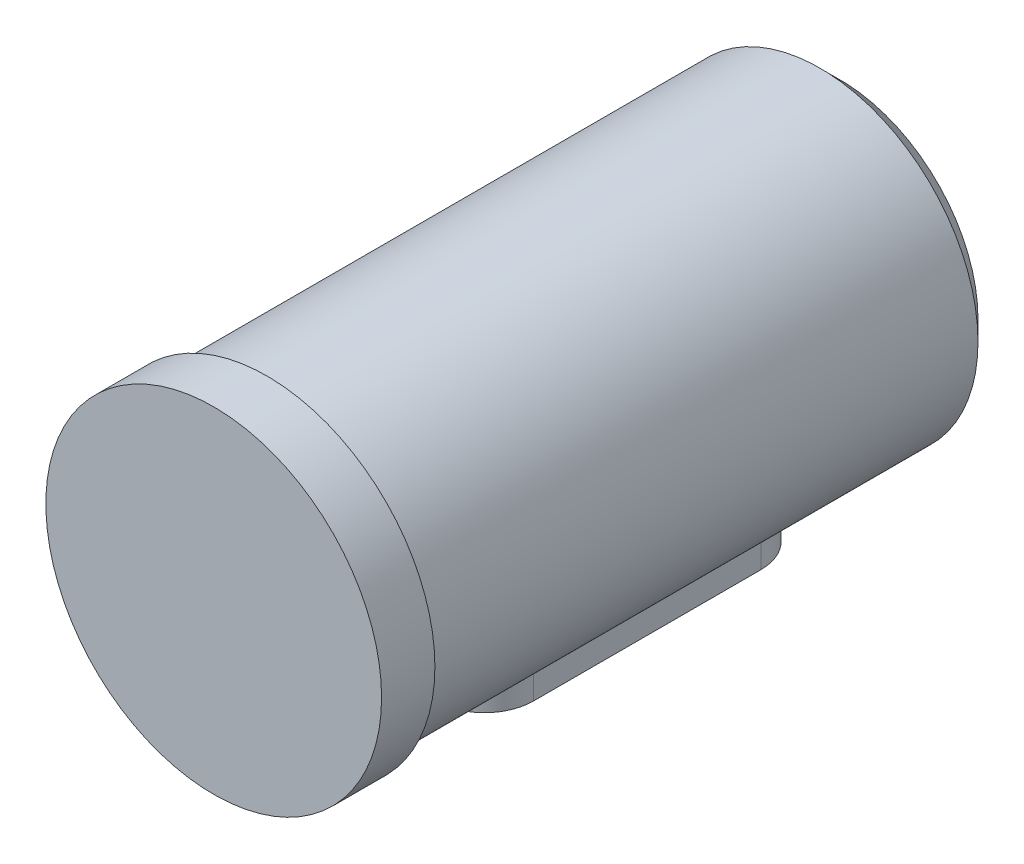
ISO-10303-21;
HEADER;
FILE_DESCRIPTION(('STEP AP214'),'2;1');
FILE_NAME('part.step','',(''),(''),'','','');
FILE_SCHEMA(('AUTOMOTIVE_DESIGN { 1 0 10303 214 1 1 1 1 }'));
ENDSEC;
DATA;
#1=APPLICATION_CONTEXT('core data for automotive mechanical design processes');
#2=APPLICATION_PROTOCOL_DEFINITION('international standard','automotive_design',2000,#1);
#3=PRODUCT_CONTEXT('',#1,'mechanical');
#4=PRODUCT('Part','Part','',(#3));
#5=PRODUCT_RELATED_PRODUCT_CATEGORY('part','',(#4));
#6=PRODUCT_DEFINITION_FORMATION('','',#4);
#7=PRODUCT_DEFINITION_CONTEXT('part definition',#1,'design');
#8=PRODUCT_DEFINITION('design','',#6,#7);
#9=PRODUCT_DEFINITION_SHAPE('','',#8);
#10=(LENGTH_UNIT() NAMED_UNIT(*) SI_UNIT(.MILLI.,.METRE.));
#11=(NAMED_UNIT(*) PLANE_ANGLE_UNIT() SI_UNIT($,.RADIAN.));
#12=(NAMED_UNIT(*) SI_UNIT($,.STERADIAN.) SOLID_ANGLE_UNIT());
#13=UNCERTAINTY_MEASURE_WITH_UNIT(LENGTH_MEASURE(1.E-05),#10,'distance_accuracy_value','');
#14=(GEOMETRIC_REPRESENTATION_CONTEXT(3) GLOBAL_UNCERTAINTY_ASSIGNED_CONTEXT((#13)) GLOBAL_UNIT_ASSIGNED_CONTEXT((#10,
#11,#12)) REPRESENTATION_CONTEXT('',''));
#15=CARTESIAN_POINT('',(0.,0.,0.));
#16=DIRECTION('',(0.,0.,1.));
#17=DIRECTION('',(1.,0.,0.));
#18=AXIS2_PLACEMENT_3D('',#15,#16,#17);
#19=CARTESIAN_POINT('',(0.,0.,0.));
#20=DIRECTION('',(0.,0.,1.));
#21=DIRECTION('',(1.,0.,0.));
#22=AXIS2_PLACEMENT_3D('',#19,#20,#21);
#23=CYLINDRICAL_SURFACE('',#22,8.);
#24=CARTESIAN_POINT('',(0.,0.,-7.7));
#25=DIRECTION('',(0.,0.,1.));
#26=DIRECTION('',(1.,0.,0.));
#27=AXIS2_PLACEMENT_3D('',#24,#25,#26);
#28=CIRCLE('',#27,8.);
#29=CARTESIAN_POINT('',(8.,0.,-7.7));
#30=VERTEX_POINT('',#29);
#31=EDGE_CURVE('E163',#30,#30,#28,.T.);
#32=ORIENTED_EDGE('',*,*,#31,.F.);
#33=EDGE_LOOP('',(#32));
#34=FACE_BOUND('',#33,.T.);
#35=CARTESIAN_POINT('',(0.,0.,-35.7));
#36=DIRECTION('',(0.,0.,1.));
#37=DIRECTION('',(1.,0.,0.));
#38=AXIS2_PLACEMENT_3D('',#35,#36,#37);
#39=CIRCLE('',#38,8.);
#40=CARTESIAN_POINT('',(8.,0.,-35.7));
#41=VERTEX_POINT('',#40);
#42=EDGE_CURVE('E40',#41,#41,#39,.T.);
#43=ORIENTED_EDGE('',*,*,#42,.T.);
#44=EDGE_LOOP('',(#43));
#45=FACE_BOUND('',#44,.T.);
#46=DIRECTION('',(0.,0.,1.));
#47=VECTOR('',#46,1.);
#48=CARTESIAN_POINT('',(2.5,-7.59934207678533,0.));
#49=LINE('',#48,#47);
#50=CARTESIAN_POINT('',(2.5,-7.59934207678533,-18.7));
#51=VERTEX_POINT('',#50);
#52=CARTESIAN_POINT('',(2.5,-7.59934207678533,-30.2));
#53=VERTEX_POINT('',#52);
#54=EDGE_CURVE('E51',#51,#53,#49,.F.);
#55=ORIENTED_EDGE('',*,*,#54,.T.);
#56=CARTESIAN_POINT('',(2.5,-7.59934207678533,-30.2));
#57=CARTESIAN_POINT('',(2.5000087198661,-7.59933203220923,-30.2684660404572));
#58=CARTESIAN_POINT('',(2.49718761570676,-7.60026710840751,-30.3369263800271));
#59=CARTESIAN_POINT('',(2.48595363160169,-7.60395280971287,-30.4733214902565));
#60=CARTESIAN_POINT('',(2.47754209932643,-7.60670299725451,-30.5412563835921));
#61=CARTESIAN_POINT('',(2.45522504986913,-7.61393458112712,-30.6759389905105));
#62=CARTESIAN_POINT('',(2.4413343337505,-7.61841131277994,-30.7426894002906));
#63=CARTESIAN_POINT('',(2.40819742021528,-7.62895048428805,-30.8747019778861));
#64=CARTESIAN_POINT('',(2.38895106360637,-7.63501297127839,-30.9399641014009));
#65=CARTESIAN_POINT('',(2.32342181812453,-7.65531370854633,-31.1327877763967));
#66=CARTESIAN_POINT('',(2.26931834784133,-7.6716757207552,-31.2575680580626));
#67=CARTESIAN_POINT('',(2.14195853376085,-7.7082019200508,-31.4962875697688));
#68=CARTESIAN_POINT('',(2.06869223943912,-7.72836808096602,-31.6102211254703));
#69=CARTESIAN_POINT('',(1.90239488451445,-7.77100200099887,-31.8279499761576));
#70=CARTESIAN_POINT('',(1.808822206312,-7.79352168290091,-31.9313222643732));
#71=CARTESIAN_POINT('',(1.60572727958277,-7.83788426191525,-32.1211908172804));
#72=CARTESIAN_POINT('',(1.49620229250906,-7.85972704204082,-32.2076841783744));
#73=CARTESIAN_POINT('',(1.26124953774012,-7.90087147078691,-32.363223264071));
#74=CARTESIAN_POINT('',(1.13551807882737,-7.92010445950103,-32.4318300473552));
#75=CARTESIAN_POINT('',(0.873602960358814,-7.95325160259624,-32.5467540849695));
#76=CARTESIAN_POINT('',(0.737422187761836,-7.96716721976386,-32.5930774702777));
#77=CARTESIAN_POINT('',(0.462930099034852,-7.98774341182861,-32.660701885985));
#78=CARTESIAN_POINT('',(0.324814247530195,-7.99461464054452,-32.6827310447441));
#79=CARTESIAN_POINT('',(0.04668447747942,-8.00107192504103,-32.7034487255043));
#80=CARTESIAN_POINT('',(-0.0933290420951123,-8.00065948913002,-32.7021420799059));
#81=CARTESIAN_POINT('',(-0.366149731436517,-7.9927423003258,-32.6767033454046));
#82=CARTESIAN_POINT('',(-0.499038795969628,-7.98548293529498,-32.6533609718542));
#83=CARTESIAN_POINT('',(-0.758907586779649,-7.96498949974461,-32.5858095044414));
#84=CARTESIAN_POINT('',(-0.885886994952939,-7.95175510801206,-32.5415992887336));
#85=CARTESIAN_POINT('',(-1.13215685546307,-7.92046911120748,-32.4330593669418));
#86=CARTESIAN_POINT('',(-1.25133405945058,-7.90236047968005,-32.3684898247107));
#87=CARTESIAN_POINT('',(-1.47740616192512,-7.86323423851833,-32.2212568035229));
#88=CARTESIAN_POINT('',(-1.58429807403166,-7.84221592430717,-32.1385889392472));
#89=CARTESIAN_POINT('',(-1.78746586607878,-7.79847545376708,-31.9534618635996));
#90=CARTESIAN_POINT('',(-1.88311543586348,-7.77571879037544,-31.8503225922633));
#91=CARTESIAN_POINT('',(-2.05596538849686,-7.73181622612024,-31.6292296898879));
#92=CARTESIAN_POINT('',(-2.13316021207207,-7.71067081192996,-31.5112716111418));
#93=CARTESIAN_POINT('',(-2.26764925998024,-7.67220528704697,-31.2620970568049));
#94=CARTESIAN_POINT('',(-2.3247002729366,-7.65493278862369,-31.1307416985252));
#95=CARTESIAN_POINT('',(-2.41560912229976,-7.6267381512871,-30.8596881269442));
#96=CARTESIAN_POINT('',(-2.4495027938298,-7.61580620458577,-30.7200031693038));
#97=CARTESIAN_POINT('',(-2.48078343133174,-7.60564225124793,-30.5158248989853));
#98=CARTESIAN_POINT('',(-2.48798807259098,-7.60328541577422,-30.452855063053));
#99=CARTESIAN_POINT('',(-2.49759244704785,-7.60013482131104,-30.3266010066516));
#100=CARTESIAN_POINT('',(-2.4999989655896,-7.59933885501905,-30.2633173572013));
#101=CARTESIAN_POINT('',(-2.5,-7.59934207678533,-30.2));
#102=B_SPLINE_CURVE_WITH_KNOTS('',3,(#56,#57,#58,#59,#60,#61,#62,#63,#64,#65,#66,#67,#68,#69,
#70,#71,#72,#73,#74,#75,#76,#77,#78,#79,#80,#81,#82,#83,#84,#85,#86,#87,#88,#89,#90,#91,#92,#93,
#94,#95,#96,#97,#98,#99,#100,#101),.UNSPECIFIED.,.F.,.F.,(4,2,2,2,2,2,2,2,2,2,2,2,2,2,2,2,2,2,2,
2,2,2,4),(0.,0.205323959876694,0.410598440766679,0.615322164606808,0.82005197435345,
1.22896577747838,1.63809233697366,2.05988351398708,2.48174718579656,2.91315381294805,
3.34444167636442,3.76241894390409,4.1803096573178,4.58377069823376,4.98725343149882,
5.39567896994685,5.80420358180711,6.22971654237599,6.65535752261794,7.08597472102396,
7.51592403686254,7.70602799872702,7.89586293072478),.UNSPECIFIED.);
#103=CARTESIAN_POINT('',(-2.5,-7.59934207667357,-30.2));
#104=VERTEX_POINT('',#103);
#105=EDGE_CURVE('E71',#53,#104,#102,.T.);
#106=ORIENTED_EDGE('',*,*,#105,.T.);
#107=DIRECTION('',(0.,0.,1.));
#108=VECTOR('',#107,1.);
#109=CARTESIAN_POINT('',(-2.5,-7.59934207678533,0.));
#110=LINE('',#109,#108);
#111=CARTESIAN_POINT('',(-2.5,-7.59934207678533,-18.7));
#112=VERTEX_POINT('',#111);
#113=EDGE_CURVE('E73',#104,#112,#110,.T.);
#114=ORIENTED_EDGE('',*,*,#113,.T.);
#115=CARTESIAN_POINT('',(-2.5,-7.59934207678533,-18.7));
#116=CARTESIAN_POINT('',(-2.5000087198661,-7.59933203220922,-18.6315339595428));
#117=CARTESIAN_POINT('',(-2.49718761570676,-7.6002671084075,-18.5630736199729));
#118=CARTESIAN_POINT('',(-2.48595363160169,-7.60395280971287,-18.4266785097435));
#119=CARTESIAN_POINT('',(-2.47754209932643,-7.60670299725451,-18.3587436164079));
#120=CARTESIAN_POINT('',(-2.45522504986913,-7.61393458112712,-18.2240610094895));
#121=CARTESIAN_POINT('',(-2.4413343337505,-7.61841131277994,-18.1573105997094));
#122=CARTESIAN_POINT('',(-2.40819742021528,-7.62895048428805,-18.0252980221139));
#123=CARTESIAN_POINT('',(-2.38895106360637,-7.63501297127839,-17.9600358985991));
#124=CARTESIAN_POINT('',(-2.32342181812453,-7.65531370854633,-17.7672122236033));
#125=CARTESIAN_POINT('',(-2.26931834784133,-7.67167572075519,-17.6424319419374));
#126=CARTESIAN_POINT('',(-2.14195853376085,-7.7082019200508,-17.4037124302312));
#127=CARTESIAN_POINT('',(-2.06869223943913,-7.72836808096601,-17.2897788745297));
#128=CARTESIAN_POINT('',(-1.90239488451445,-7.77100200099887,-17.0720500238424));
#129=CARTESIAN_POINT('',(-1.808822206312,-7.7935216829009,-16.9686777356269));
#130=CARTESIAN_POINT('',(-1.60572727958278,-7.83788426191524,-16.7788091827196));
#131=CARTESIAN_POINT('',(-1.49620229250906,-7.85972704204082,-16.6923158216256));
#132=CARTESIAN_POINT('',(-1.26124953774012,-7.90087147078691,-16.536776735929));
#133=CARTESIAN_POINT('',(-1.13551807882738,-7.92010445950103,-16.4681699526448));
#134=CARTESIAN_POINT('',(-0.873602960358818,-7.95325160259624,-16.3532459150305));
#135=CARTESIAN_POINT('',(-0.737422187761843,-7.96716721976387,-16.3069225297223));
#136=CARTESIAN_POINT('',(-0.46293009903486,-7.98774341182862,-16.239298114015));
#137=CARTESIAN_POINT('',(-0.324814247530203,-7.99461464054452,-16.2172689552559));
#138=CARTESIAN_POINT('',(-0.0466844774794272,-8.00107192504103,-16.1965512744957));
#139=CARTESIAN_POINT('',(0.0933290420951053,-8.00065948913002,-16.1978579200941));
#140=CARTESIAN_POINT('',(0.366149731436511,-7.9927423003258,-16.2232966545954));
#141=CARTESIAN_POINT('',(0.499038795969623,-7.98548293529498,-16.2466390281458));
#142=CARTESIAN_POINT('',(0.758907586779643,-7.96498949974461,-16.3141904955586));
#143=CARTESIAN_POINT('',(0.885886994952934,-7.95175510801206,-16.3584007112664));
#144=CARTESIAN_POINT('',(1.13215685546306,-7.92046911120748,-16.4669406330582));
#145=CARTESIAN_POINT('',(1.25133405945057,-7.90236047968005,-16.5315101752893));
#146=CARTESIAN_POINT('',(1.47740616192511,-7.86323423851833,-16.6787431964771));
#147=CARTESIAN_POINT('',(1.58429807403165,-7.84221592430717,-16.7614110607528));
#148=CARTESIAN_POINT('',(1.78746586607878,-7.79847545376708,-16.9465381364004));
#149=CARTESIAN_POINT('',(1.88311543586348,-7.77571879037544,-17.0496774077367));
#150=CARTESIAN_POINT('',(2.05596538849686,-7.73181622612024,-17.2707703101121));
#151=CARTESIAN_POINT('',(2.13316021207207,-7.71067081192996,-17.3887283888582));
#152=CARTESIAN_POINT('',(2.26764925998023,-7.67220528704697,-17.6379029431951));
#153=CARTESIAN_POINT('',(2.3247002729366,-7.65493278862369,-17.7692583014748));
#154=CARTESIAN_POINT('',(2.41560912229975,-7.6267381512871,-18.0403118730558));
#155=CARTESIAN_POINT('',(2.44950279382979,-7.61580620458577,-18.1799968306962));
#156=CARTESIAN_POINT('',(2.48078343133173,-7.60564225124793,-18.3841751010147));
#157=CARTESIAN_POINT('',(2.48798807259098,-7.60328541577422,-18.447144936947));
#158=CARTESIAN_POINT('',(2.49759244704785,-7.60013482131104,-18.5733989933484));
#159=CARTESIAN_POINT('',(2.4999989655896,-7.59933885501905,-18.6366826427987));
#160=CARTESIAN_POINT('',(2.5,-7.59934207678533,-18.7));
#161=B_SPLINE_CURVE_WITH_KNOTS('',3,(#115,#116,#117,#118,#119,#120,#121,#122,#123,#124,#125,
#126,#127,#128,#129,#130,#131,#132,#133,#134,#135,#136,#137,#138,#139,#140,#141,#142,#143,#144,
#145,#146,#147,#148,#149,#150,#151,#152,#153,#154,#155,#156,#157,#158,#159,#160),.UNSPECIFIED.,
.F.,.F.,(4,2,2,2,2,2,2,2,2,2,2,2,2,2,2,2,2,2,2,2,2,2,4),(0.,0.205323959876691,0.410598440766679,
0.615322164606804,0.820051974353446,1.22896577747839,1.63809233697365,2.05988351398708,
2.48174718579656,2.91315381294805,3.34444167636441,3.76241894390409,4.18030965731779,
4.58377069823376,4.98725343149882,5.39567896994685,5.8042035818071,6.22971654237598,
6.65535752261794,7.08597472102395,7.51592403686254,7.70602799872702,7.89586293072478),.UNSPECIFIED.);
#162=EDGE_CURVE('E47',#112,#51,#161,.T.);
#163=ORIENTED_EDGE('',*,*,#162,.T.);
#164=EDGE_LOOP('',(#55,#106,#114,#163));
#165=FACE_BOUND('',#164,.T.);
#166=ADVANCED_FACE('F32',(#34,#45,#165),#23,.T.);
#167=CARTESIAN_POINT('',(0.,8.5,-5.));
#168=DIRECTION('',(0.,0.,-1.));
#169=DIRECTION('',(-1.,0.,0.));
#170=AXIS2_PLACEMENT_3D('',#167,#168,#169);
#171=PLANE('',#170);
#172=CARTESIAN_POINT('',(0.,0.,-5.));
#173=DIRECTION('',(0.,0.,1.));
#174=DIRECTION('',(1.,0.,0.));
#175=AXIS2_PLACEMENT_3D('',#172,#173,#174);
#176=CIRCLE('',#175,8.5);
#177=CARTESIAN_POINT('',(8.5,0.,-5.));
#178=VERTEX_POINT('',#177);
#179=EDGE_CURVE('E159',#178,#178,#176,.T.);
#180=ORIENTED_EDGE('',*,*,#179,.T.);
#181=EDGE_LOOP('',(#180));
#182=FACE_BOUND('',#181,.T.);
#183=ADVANCED_FACE('F34',(#182),#171,.F.);
#184=CARTESIAN_POINT('',(0.,0.,0.));
#185=DIRECTION('',(0.,0.,1.));
#186=DIRECTION('',(1.,0.,0.));
#187=AXIS2_PLACEMENT_3D('',#184,#185,#186);
#188=CYLINDRICAL_SURFACE('',#187,8.5);
#189=ORIENTED_EDGE('',*,*,#179,.F.);
#190=EDGE_LOOP('',(#189));
#191=FACE_BOUND('',#190,.T.);
#192=CARTESIAN_POINT('',(0.,0.,-7.7));
#193=DIRECTION('',(0.,0.,1.));
#194=DIRECTION('',(1.,0.,0.));
#195=AXIS2_PLACEMENT_3D('',#192,#193,#194);
#196=CIRCLE('',#195,8.5);
#197=CARTESIAN_POINT('',(8.5,0.,-7.7));
#198=VERTEX_POINT('',#197);
#199=EDGE_CURVE('E162',#198,#198,#196,.T.);
#200=ORIENTED_EDGE('',*,*,#199,.T.);
#201=EDGE_LOOP('',(#200));
#202=FACE_BOUND('',#201,.T.);
#203=ADVANCED_FACE('F148',(#191,#202),#188,.T.);
#204=CARTESIAN_POINT('',(0.,8.5,-7.7));
#205=DIRECTION('',(0.,0.,1.));
#206=DIRECTION('',(1.,0.,0.));
#207=AXIS2_PLACEMENT_3D('',#204,#205,#206);
#208=PLANE('',#207);
#209=ORIENTED_EDGE('',*,*,#199,.F.);
#210=EDGE_LOOP('',(#209));
#211=FACE_BOUND('',#210,.T.);
#212=ORIENTED_EDGE('',*,*,#31,.T.);
#213=EDGE_LOOP('',(#212));
#214=FACE_BOUND('',#213,.T.);
#215=ADVANCED_FACE('F142',(#211,#214),#208,.F.);
#216=CARTESIAN_POINT('',(0.,8.,-36.7));
#217=DIRECTION('',(0.,0.,1.));
#218=DIRECTION('',(1.,0.,0.));
#219=AXIS2_PLACEMENT_3D('',#216,#217,#218);
#220=PLANE('',#219);
#221=CARTESIAN_POINT('',(0.,0.,-36.7));
#222=DIRECTION('',(0.,0.,-1.));
#223=DIRECTION('',(-1.,0.,0.));
#224=AXIS2_PLACEMENT_3D('',#221,#222,#223);
#225=CIRCLE('',#224,3.5);
#226=CARTESIAN_POINT('',(-3.5,0.,-36.7));
#227=VERTEX_POINT('',#226);
#228=EDGE_CURVE('E178',#227,#227,#225,.T.);
#229=ORIENTED_EDGE('',*,*,#228,.F.);
#230=EDGE_LOOP('',(#229));
#231=FACE_BOUND('',#230,.T.);
#232=CARTESIAN_POINT('',(0.,0.,-36.7));
#233=DIRECTION('',(0.,0.,1.));
#234=DIRECTION('',(1.,0.,0.));
#235=AXIS2_PLACEMENT_3D('',#232,#233,#234);
#236=CIRCLE('',#235,6.99999999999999);
#237=CARTESIAN_POINT('',(6.99999999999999,0.,-36.7));
#238=VERTEX_POINT('',#237);
#239=EDGE_CURVE('E11',#238,#238,#236,.F.);
#240=ORIENTED_EDGE('',*,*,#239,.T.);
#241=EDGE_LOOP('',(#240));
#242=FACE_BOUND('',#241,.T.);
#243=ADVANCED_FACE('F138',(#231,#242),#220,.F.);
#244=CARTESIAN_POINT('',(0.,0.,-35.7));
#245=DIRECTION('',(0.,0.,1.));
#246=DIRECTION('',(1.,0.,0.));
#247=AXIS2_PLACEMENT_3D('',#244,#245,#246);
#248=CONICAL_SURFACE('',#247,8.,0.785398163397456);
#249=ORIENTED_EDGE('',*,*,#239,.F.);
#250=EDGE_LOOP('',(#249));
#251=FACE_BOUND('',#250,.T.);
#252=ORIENTED_EDGE('',*,*,#42,.F.);
#253=EDGE_LOOP('',(#252));
#254=FACE_BOUND('',#253,.T.);
#255=ADVANCED_FACE('F134',(#251,#254),#248,.T.);
#256=CARTESIAN_POINT('',(0.,0.,-17.7));
#257=DIRECTION('',(0.,0.,-1.));
#258=DIRECTION('',(-1.,0.,0.));
#259=AXIS2_PLACEMENT_3D('',#256,#257,#258);
#260=CONICAL_SURFACE('',#259,2.49999999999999,1.02974425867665);
#261=CARTESIAN_POINT('',(0.,0.,-16.1978484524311));
#262=VERTEX_POINT('',#261);
#263=VERTEX_LOOP('',#262);
#264=FACE_BOUND('',#263,.T.);
#265=CARTESIAN_POINT('',(0.,0.,-17.7));
#266=DIRECTION('',(0.,0.,-1.));
#267=DIRECTION('',(-1.,0.,0.));
#268=AXIS2_PLACEMENT_3D('',#265,#266,#267);
#269=CIRCLE('',#268,2.49999999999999);
#270=CARTESIAN_POINT('',(-2.49999999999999,0.,-17.7));
#271=VERTEX_POINT('',#270);
#272=EDGE_CURVE('E167',#271,#271,#269,.T.);
#273=ORIENTED_EDGE('',*,*,#272,.T.);
#274=EDGE_LOOP('',(#273));
#275=FACE_BOUND('',#274,.T.);
#276=ADVANCED_FACE('F130',(#264,#275),#260,.F.);
#277=CARTESIAN_POINT('',(0.,0.,-36.7));
#278=DIRECTION('',(0.,0.,-1.));
#279=DIRECTION('',(-1.,0.,0.));
#280=AXIS2_PLACEMENT_3D('',#277,#278,#279);
#281=CYLINDRICAL_SURFACE('',#280,2.49999999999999);
#282=ORIENTED_EDGE('',*,*,#272,.F.);
#283=EDGE_LOOP('',(#282));
#284=FACE_BOUND('',#283,.T.);
#285=CARTESIAN_POINT('',(0.,0.,-32.9679491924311));
#286=DIRECTION('',(0.,0.,-1.));
#287=DIRECTION('',(-1.,0.,0.));
#288=AXIS2_PLACEMENT_3D('',#285,#286,#287);
#289=CIRCLE('',#288,2.5);
#290=CARTESIAN_POINT('',(-2.5,0.,-32.9679491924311));
#291=VERTEX_POINT('',#290);
#292=EDGE_CURVE('E176',#291,#291,#289,.T.);
#293=ORIENTED_EDGE('',*,*,#292,.T.);
#294=EDGE_LOOP('',(#293));
#295=FACE_BOUND('',#294,.T.);
#296=ADVANCED_FACE('F126',(#284,#295),#281,.F.);
#297=CARTESIAN_POINT('',(0.,0.,-36.7));
#298=DIRECTION('',(0.,0.,-1.));
#299=DIRECTION('',(-1.,0.,0.));
#300=AXIS2_PLACEMENT_3D('',#297,#298,#299);
#301=CONICAL_SURFACE('',#300,3.5,0.26179938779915);
#302=ORIENTED_EDGE('',*,*,#292,.F.);
#303=EDGE_LOOP('',(#302));
#304=FACE_BOUND('',#303,.T.);
#305=ORIENTED_EDGE('',*,*,#228,.T.);
#306=EDGE_LOOP('',(#305));
#307=FACE_BOUND('',#306,.T.);
#308=ADVANCED_FACE('F123',(#304,#307),#301,.F.);
#309=CARTESIAN_POINT('',(2.5,500000.,-18.7));
#310=DIRECTION('',(-1.,0.,0.));
#311=DIRECTION('',(0.,0.,1.));
#312=AXIS2_PLACEMENT_3D('',#309,#310,#311);
#313=PLANE('',#312);
#314=ORIENTED_EDGE('',*,*,#54,.F.);
#315=DIRECTION('',(0.,-1.,0.));
#316=VECTOR('',#315,1.);
#317=CARTESIAN_POINT('',(2.5,500000.,-18.7));
#318=LINE('',#317,#316);
#319=CARTESIAN_POINT('',(2.5,-10.,-18.7));
#320=VERTEX_POINT('',#319);
#321=EDGE_CURVE('E94',#51,#320,#318,.T.);
#322=ORIENTED_EDGE('',*,*,#321,.T.);
#323=DIRECTION('',(0.,0.,-1.));
#324=VECTOR('',#323,1.);
#325=CARTESIAN_POINT('',(2.5,-10.,-18.7));
#326=LINE('',#325,#324);
#327=CARTESIAN_POINT('',(2.5,-10.,-30.2));
#328=VERTEX_POINT('',#327);
#329=EDGE_CURVE('E184',#320,#328,#326,.T.);
#330=ORIENTED_EDGE('',*,*,#329,.T.);
#331=DIRECTION('',(0.,-1.,0.));
#332=VECTOR('',#331,1.);
#333=CARTESIAN_POINT('',(2.5,500000.,-30.2));
#334=LINE('',#333,#332);
#335=EDGE_CURVE('E90',#53,#328,#334,.T.);
#336=ORIENTED_EDGE('',*,*,#335,.F.);
#337=EDGE_LOOP('',(#314,#322,#330,#336));
#338=FACE_BOUND('',#337,.T.);
#339=ADVANCED_FACE('F112',(#338),#313,.F.);
#340=CARTESIAN_POINT('',(0.,500000.,-18.7));
#341=DIRECTION('',(0.,-1.,0.));
#342=DIRECTION('',(0.,0.,-1.));
#343=AXIS2_PLACEMENT_3D('',#340,#341,#342);
#344=CYLINDRICAL_SURFACE('',#343,2.5);
#345=ORIENTED_EDGE('',*,*,#162,.F.);
#346=DIRECTION('',(0.,-1.,0.));
#347=VECTOR('',#346,1.);
#348=CARTESIAN_POINT('',(-2.5,500000.,-18.7));
#349=LINE('',#348,#347);
#350=CARTESIAN_POINT('',(-2.5,-10.,-18.7));
#351=VERTEX_POINT('',#350);
#352=EDGE_CURVE('E84',#112,#351,#349,.T.);
#353=ORIENTED_EDGE('',*,*,#352,.T.);
#354=CARTESIAN_POINT('',(0.,-10.,-18.7));
#355=DIRECTION('',(0.,1.,0.));
#356=DIRECTION('',(0.,0.,1.));
#357=AXIS2_PLACEMENT_3D('',#354,#355,#356);
#358=CIRCLE('',#357,2.5);
#359=EDGE_CURVE('E180',#351,#320,#358,.T.);
#360=ORIENTED_EDGE('',*,*,#359,.T.);
#361=ORIENTED_EDGE('',*,*,#321,.F.);
#362=EDGE_LOOP('',(#345,#353,#360,#361));
#363=FACE_BOUND('',#362,.T.);
#364=ADVANCED_FACE('F105',(#363),#344,.T.);
#365=CARTESIAN_POINT('',(0.,-10.,-18.7));
#366=DIRECTION('',(0.,1.,0.));
#367=DIRECTION('',(0.,0.,1.));
#368=AXIS2_PLACEMENT_3D('',#365,#366,#367);
#369=PLANE('',#368);
#370=ORIENTED_EDGE('',*,*,#359,.F.);
#371=DIRECTION('',(0.,0.,1.));
#372=VECTOR('',#371,1.);
#373=CARTESIAN_POINT('',(-2.5,-10.,-30.2));
#374=LINE('',#373,#372);
#375=CARTESIAN_POINT('',(-2.5,-10.,-30.2));
#376=VERTEX_POINT('',#375);
#377=EDGE_CURVE('E92',#376,#351,#374,.T.);
#378=ORIENTED_EDGE('',*,*,#377,.F.);
#379=CARTESIAN_POINT('',(0.,-10.,-30.2));
#380=DIRECTION('',(0.,1.,0.));
#381=DIRECTION('',(0.,0.,1.));
#382=AXIS2_PLACEMENT_3D('',#379,#380,#381);
#383=CIRCLE('',#382,2.5);
#384=EDGE_CURVE('E88',#328,#376,#383,.T.);
#385=ORIENTED_EDGE('',*,*,#384,.F.);
#386=ORIENTED_EDGE('',*,*,#329,.F.);
#387=EDGE_LOOP('',(#370,#378,#385,#386));
#388=FACE_BOUND('',#387,.T.);
#389=ADVANCED_FACE('F111',(#388),#369,.F.);
#390=CARTESIAN_POINT('',(0.,500000.,-30.2));
#391=DIRECTION('',(0.,-1.,0.));
#392=DIRECTION('',(0.,0.,-1.));
#393=AXIS2_PLACEMENT_3D('',#390,#391,#392);
#394=CYLINDRICAL_SURFACE('',#393,2.5);
#395=ORIENTED_EDGE('',*,*,#105,.F.);
#396=ORIENTED_EDGE('',*,*,#335,.T.);
#397=ORIENTED_EDGE('',*,*,#384,.T.);
#398=DIRECTION('',(0.,-1.,0.));
#399=VECTOR('',#398,1.);
#400=CARTESIAN_POINT('',(-2.5,500000.,-30.2));
#401=LINE('',#400,#399);
#402=EDGE_CURVE('E82',#104,#376,#401,.T.);
#403=ORIENTED_EDGE('',*,*,#402,.F.);
#404=EDGE_LOOP('',(#395,#396,#397,#403));
#405=FACE_BOUND('',#404,.T.);
#406=ADVANCED_FACE('F86',(#405),#394,.T.);
#407=CARTESIAN_POINT('',(-2.5,500000.,-30.2));
#408=DIRECTION('',(1.,0.,0.));
#409=DIRECTION('',(0.,0.,-1.));
#410=AXIS2_PLACEMENT_3D('',#407,#408,#409);
#411=PLANE('',#410);
#412=ORIENTED_EDGE('',*,*,#113,.F.);
#413=ORIENTED_EDGE('',*,*,#402,.T.);
#414=ORIENTED_EDGE('',*,*,#377,.T.);
#415=ORIENTED_EDGE('',*,*,#352,.F.);
#416=EDGE_LOOP('',(#412,#413,#414,#415));
#417=FACE_BOUND('',#416,.T.);
#418=ADVANCED_FACE('F80',(#417),#411,.F.);
#419=CLOSED_SHELL('',(#166,#183,#203,#215,#243,#255,#276,#296,#308,#339,#364,#389,#406,#418));
#420=MANIFOLD_SOLID_BREP('B2',#419);
#421=ADVANCED_BREP_SHAPE_REPRESENTATION('',(#18,#420),#14);
#422=SHAPE_DEFINITION_REPRESENTATION(#9,#421);
ENDSEC;
END-ISO-10303-21;
